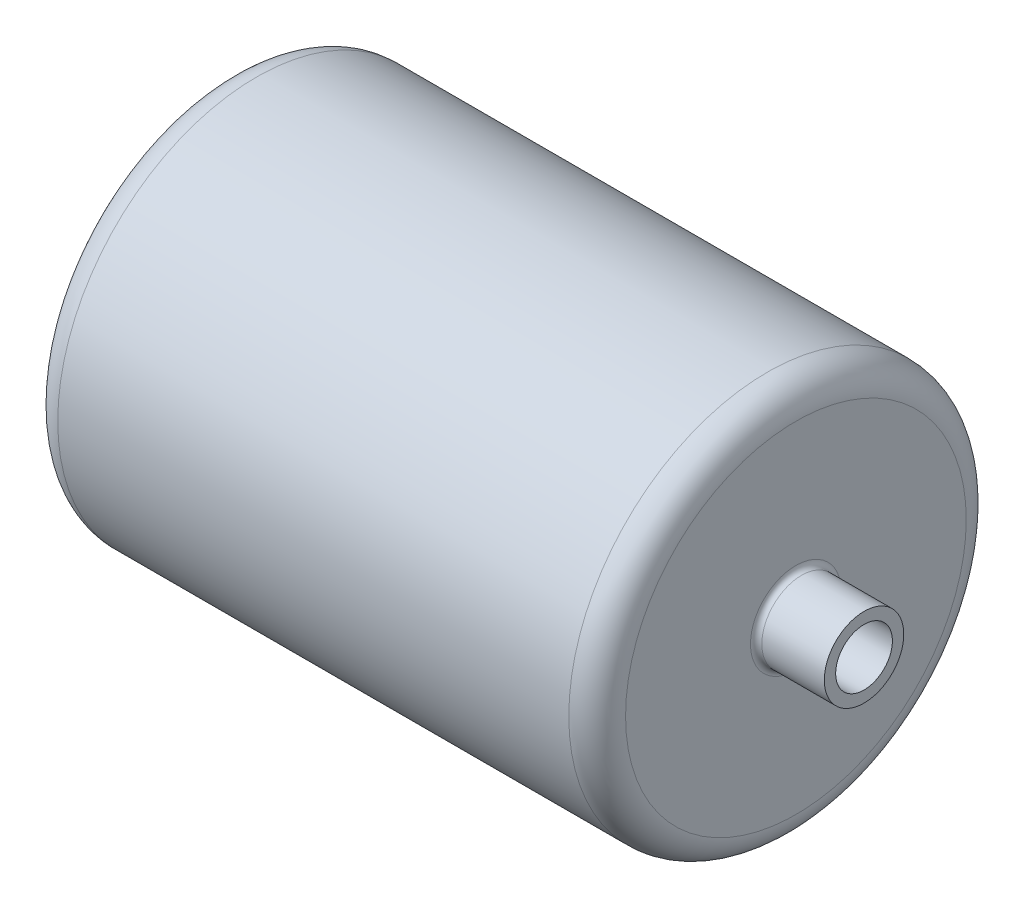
from build123d import *

# Parameters (mm, degrees)
PIPE_CONNECTOR_FILLET_R = 5


with BuildPart() as part:
    # Sketch1 → Revolve1 (revolve)
    with BuildSketch(Plane.XY, mode=Mode.PRIVATE) as revolve1_sk:
        with BuildLine():
            Line((-225, 175), (225, 175))
            ThreePointArc((225, 175), (242.67766953, 167.67766953), (250, 150))
            Line((250, 150), (250, 35))
            Line((250, 35), (310, 35))
            Line((310, 35), (310, 25))
            Line((310, 25), (225, 25))
            Line((225, 25), (225, 137.5))
            ThreePointArc((225, 137.5), (221.338834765, 146.338834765), (212.5, 150))
            Line((212.5, 150), (-212.5, 150))
            ThreePointArc((-212.5, 150), (-221.338834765, 146.338834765), (-225, 137.5))
            Line((-225, 137.5), (-225, 0))
            Line((-225, 0), (-250, 0))
            Line((-250, 0), (-250, 150))
            ThreePointArc((-250, 150), (-242.67766953, 167.67766953), (-225, 175))
        make_face()
    revolve(revolve1_sk.sketch.rotate(Axis((-162.28666216, 0, 0), (1, 0, 0)), 90), axis=Axis((-162.28666216, 0, 0), (1, 0, 0)))

    # Pipe Connector Fillet
    pipe_connector_fillet_edges = [part.edges().sort_by_distance(p)[0] for p in [
        (250, 0, -35),
    ]]
    fillet(pipe_connector_fillet_edges, radius=PIPE_CONNECTOR_FILLET_R)


solid = part.part
